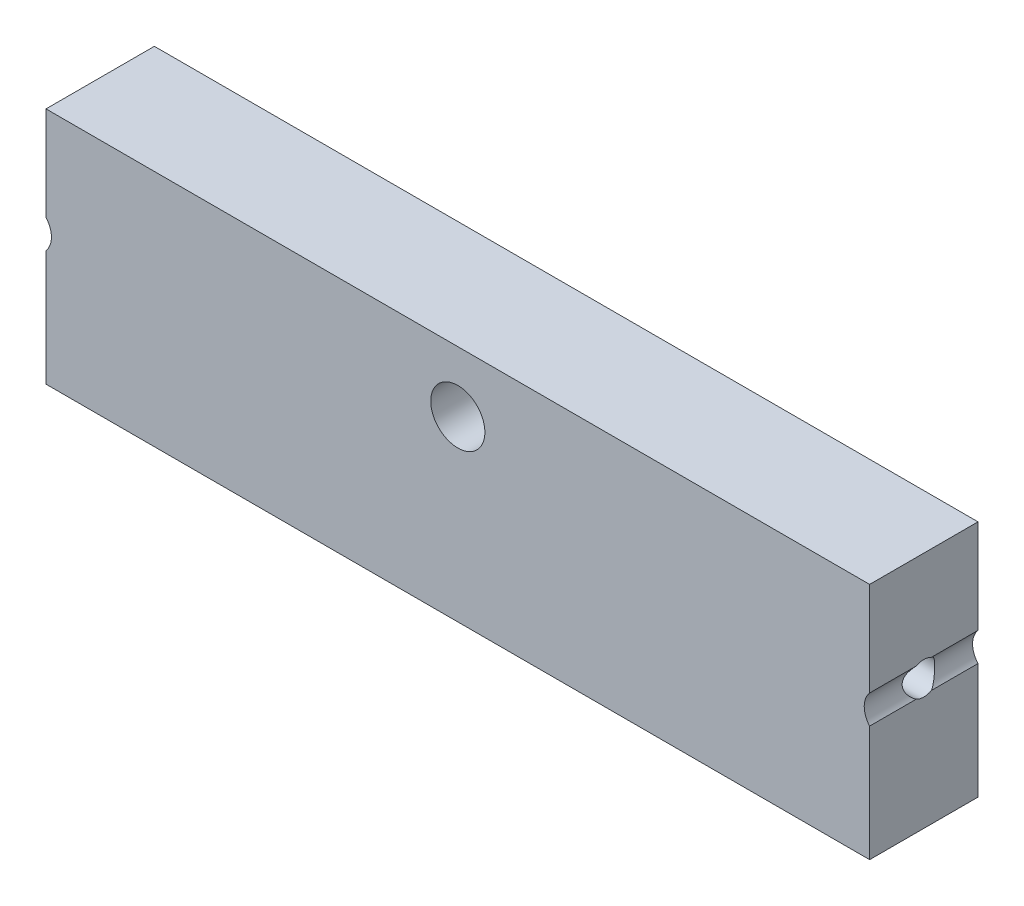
from build123d import *

# Parameters (mm, degrees)
ESQUISSE1_W             = 76
ESQUISSE1_H             = 22
BASE_EXTRUSION_DEPTH    = 10
ESQUISSE2_R             = 2.5
ENL_V_MAT_EXTRU_1_DEPTH = 10
ESQUISSE3_R             = 1.5
ENL_V_MAT_EXTRU_2_DEPTH = 10
ENL_V_START             = -10
ESQUISSE4_R             = 1.5
ENL_V_MAT_EXTRU_3_DEPTH = 10
ESQUISSE5_R             = 2
ENL_V_MAT_EXTRU_4_DEPTH = 10


with BuildPart() as part:
    # Esquisse1 → Base-Extrusion (new body)
    with BuildSketch(Plane.XY):
        with Locations((-54.369945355, 16.176612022)):
            Rectangle(ESQUISSE1_W, ESQUISSE1_H)
    extrude(amount=BASE_EXTRUSION_DEPTH)

    # Esquisse2 → Enl_v. mat.-Extru.1 (cut)
    with BuildSketch(Plane.XY.offset(10)):
        with Locations((-54.369945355, 21.576612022)):
            Circle(ESQUISSE2_R)
    extrude(amount=-ENL_V_MAT_EXTRU_1_DEPTH, mode=Mode.SUBTRACT)

    # Esquisse3 → Enl_v. mat.-Extru.2 (cut)
    with BuildSketch(Plane.ZY.offset(92.369945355)):
        with Locations((5, 17.176612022)):
            Circle(ESQUISSE3_R)
    extrude(amount=-ENL_V_MAT_EXTRU_2_DEPTH, mode=Mode.SUBTRACT)

    # Esquisse4 → Enl_v. mat.-Extru.3 (cut)
    with BuildSketch(Plane(origin=(-16.369945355, 0, 0), x_dir=(0, 0, -1), z_dir=(1, 0, 0)).offset(ENL_V_START)):
        with Locations(Location((-5, 17.176612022, 0), (0, 0, 180))):
            Circle(ESQUISSE4_R)
    extrude(amount=ENL_V_MAT_EXTRU_3_DEPTH, mode=Mode.SUBTRACT)

    # Esquisse5 → Enl_v. mat.-Extru.4 (cut)
    with BuildSketch(Plane(origin=(0, 0, 0), x_dir=(-1, 0, 0), z_dir=(0, 0, -1))):
        with Locations((93.869945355, 17.176612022)):
            Circle(ESQUISSE5_R)
        with Locations((14.869945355, 17.176612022)):
            Circle(ESQUISSE5_R)
    extrude(amount=-ENL_V_MAT_EXTRU_4_DEPTH, mode=Mode.SUBTRACT)


solid = part.part
